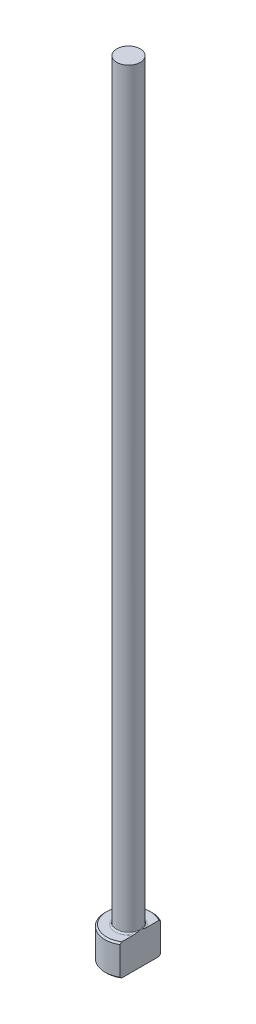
from build123d import *
from build123d.topology import SkipClean

# Parameters (mm, degrees)
CHAMFER1_SIZE    = 0.2
FILLET1_R        = 0.2
KEYED_HEAD_DEPTH = 101.089959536


with BuildPart() as part:
    # Sketch1 → Revolve1 (revolve)
    with BuildSketch(Plane.XY, mode=Mode.PRIVATE) as revolve1_sk:
        Polygon((0, 0), (-3, 0), (-3, 4), (-1.5, 4), (-1.5, 100), (0, 100), align=None)
    revolve(revolve1_sk.sketch.rotate(Axis((0, 259.958771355, 0), (0, -1, 0)), 270), axis=Axis((0, 259.958771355, 0), (0, -1, 0)))

    # Chamfer1
    chamfer1_edges = [part.edges().sort_by_distance(p)[0] for p in [
        (0, 4, -3),
        (0, 0, -3),
    ]]
    chamfer(chamfer1_edges, length=CHAMFER1_SIZE)

    # Fillet1
    fillet1_edges = [part.edges().sort_by_distance(p)[0] for p in [
        (0, 4, -1.5),
    ]]
    fillet(fillet1_edges, radius=FILLET1_R)

    # Sketch2 → KEYED HEAD (cut, through all)
    with SkipClean():  # the faces are left unmerged after this step: merging them gives an invalid solid
        with BuildSketch(Plane(origin=(0, 0, 0), x_dir=(1, 0, 0), z_dir=(0, 1, 0))):
            with BuildLine():
                Line((1.5, -2.598076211), (1.5, 2.598076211))
                ThreePointArc((1.5, 2.598076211), (3, 0), (1.5, -2.598076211))
            make_face()
        extrude(amount=KEYED_HEAD_DEPTH, mode=Mode.SUBTRACT)


solid = part.part
